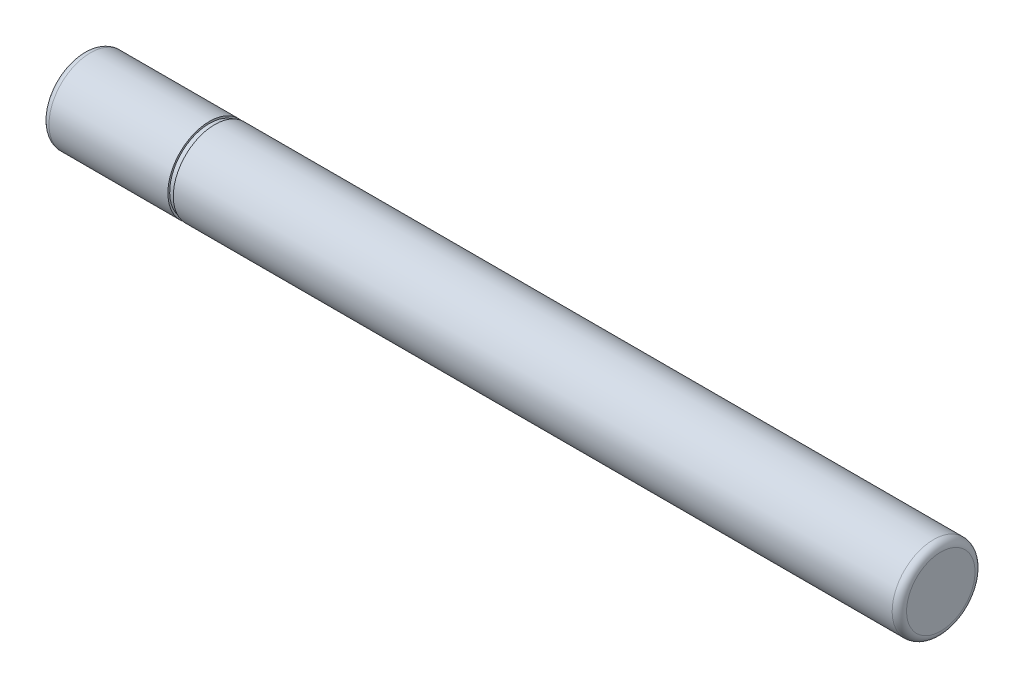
ISO-10303-21;
HEADER;
FILE_DESCRIPTION(('STEP AP214'),'2;1');
FILE_NAME('part.step','',(''),(''),'','','');
FILE_SCHEMA(('AUTOMOTIVE_DESIGN { 1 0 10303 214 1 1 1 1 }'));
ENDSEC;
DATA;
#1=APPLICATION_CONTEXT('core data for automotive mechanical design processes');
#2=APPLICATION_PROTOCOL_DEFINITION('international standard','automotive_design',2000,#1);
#3=PRODUCT_CONTEXT('',#1,'mechanical');
#4=PRODUCT('Part','Part','',(#3));
#5=PRODUCT_RELATED_PRODUCT_CATEGORY('part','',(#4));
#6=PRODUCT_DEFINITION_FORMATION('','',#4);
#7=PRODUCT_DEFINITION_CONTEXT('part definition',#1,'design');
#8=PRODUCT_DEFINITION('design','',#6,#7);
#9=PRODUCT_DEFINITION_SHAPE('','',#8);
#10=(LENGTH_UNIT() NAMED_UNIT(*) SI_UNIT(.MILLI.,.METRE.));
#11=(NAMED_UNIT(*) PLANE_ANGLE_UNIT() SI_UNIT($,.RADIAN.));
#12=(NAMED_UNIT(*) SI_UNIT($,.STERADIAN.) SOLID_ANGLE_UNIT());
#13=UNCERTAINTY_MEASURE_WITH_UNIT(LENGTH_MEASURE(1.E-05),#10,'distance_accuracy_value','');
#14=(GEOMETRIC_REPRESENTATION_CONTEXT(3) GLOBAL_UNCERTAINTY_ASSIGNED_CONTEXT((#13)) GLOBAL_UNIT_ASSIGNED_CONTEXT((#10,
#11,#12)) REPRESENTATION_CONTEXT('',''));
#15=CARTESIAN_POINT('',(0.,0.,0.));
#16=DIRECTION('',(0.,0.,1.));
#17=DIRECTION('',(1.,0.,0.));
#18=AXIS2_PLACEMENT_3D('',#15,#16,#17);
#19=CARTESIAN_POINT('',(237.,-11.4999999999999,0.));
#20=DIRECTION('',(1.,0.,0.));
#21=DIRECTION('',(0.,1.,0.));
#22=AXIS2_PLACEMENT_3D('',#19,#20,#21);
#23=PLANE('',#22);
#24=CARTESIAN_POINT('',(237.,0.,0.));
#25=DIRECTION('',(1.,0.,0.));
#26=DIRECTION('',(0.,1.,0.));
#27=AXIS2_PLACEMENT_3D('',#24,#25,#26);
#28=CIRCLE('',#27,9.49999999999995);
#29=CARTESIAN_POINT('',(237.,9.49999999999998,0.));
#30=VERTEX_POINT('',#29);
#31=EDGE_CURVE('E42',#30,#30,#28,.T.);
#32=ORIENTED_EDGE('',*,*,#31,.T.);
#33=EDGE_LOOP('',(#32));
#34=FACE_BOUND('',#33,.T.);
#35=ADVANCED_FACE('F35',(#34),#23,.T.);
#36=CARTESIAN_POINT('',(0.,-4.99999999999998,0.));
#37=DIRECTION('',(-1.,0.,0.));
#38=DIRECTION('',(0.,-1.,0.));
#39=AXIS2_PLACEMENT_3D('',#36,#37,#38);
#40=PLANE('',#39);
#41=CARTESIAN_POINT('',(0.,0.,0.));
#42=DIRECTION('',(1.,0.,0.));
#43=DIRECTION('',(0.,1.,0.));
#44=AXIS2_PLACEMENT_3D('',#41,#42,#43);
#45=CIRCLE('',#44,7.99999999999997);
#46=CARTESIAN_POINT('',(0.,7.99999999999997,0.));
#47=VERTEX_POINT('',#46);
#48=EDGE_CURVE('E55',#47,#47,#45,.T.);
#49=ORIENTED_EDGE('',*,*,#48,.F.);
#50=EDGE_LOOP('',(#49));
#51=FACE_BOUND('',#50,.T.);
#52=ADVANCED_FACE('F91',(#51),#40,.T.);
#53=CARTESIAN_POINT('',(0.,0.,0.));
#54=DIRECTION('',(1.,0.,0.));
#55=DIRECTION('',(0.,1.,0.));
#56=AXIS2_PLACEMENT_3D('',#53,#54,#55);
#57=CYLINDRICAL_SURFACE('',#56,7.99999999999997);
#58=ORIENTED_EDGE('',*,*,#48,.T.);
#59=EDGE_LOOP('',(#58));
#60=FACE_BOUND('',#59,.T.);
#61=CARTESIAN_POINT('',(-1.,0.,0.));
#62=DIRECTION('',(1.,0.,0.));
#63=DIRECTION('',(0.,1.,0.));
#64=AXIS2_PLACEMENT_3D('',#61,#62,#63);
#65=CIRCLE('',#64,7.99999999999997);
#66=CARTESIAN_POINT('',(-1.,7.99999999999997,0.));
#67=VERTEX_POINT('',#66);
#68=EDGE_CURVE('E58',#67,#67,#65,.T.);
#69=ORIENTED_EDGE('',*,*,#68,.F.);
#70=EDGE_LOOP('',(#69));
#71=FACE_BOUND('',#70,.T.);
#72=ADVANCED_FACE('F96',(#60,#71),#57,.F.);
#73=CARTESIAN_POINT('',(-0.999999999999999,-7.99999999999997,0.));
#74=DIRECTION('',(-1.,0.,0.));
#75=DIRECTION('',(0.,-1.,0.));
#76=AXIS2_PLACEMENT_3D('',#73,#74,#75);
#77=PLANE('',#76);
#78=CARTESIAN_POINT('',(-1.,0.,0.));
#79=DIRECTION('',(-1.,0.,0.));
#80=DIRECTION('',(0.,-1.,0.));
#81=AXIS2_PLACEMENT_3D('',#78,#79,#80);
#82=CIRCLE('',#81,9.49999999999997);
#83=CARTESIAN_POINT('',(-0.999999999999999,-9.49999999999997,0.));
#84=VERTEX_POINT('',#83);
#85=EDGE_CURVE('E46',#84,#84,#82,.T.);
#86=ORIENTED_EDGE('',*,*,#85,.T.);
#87=EDGE_LOOP('',(#86));
#88=FACE_BOUND('',#87,.T.);
#89=ORIENTED_EDGE('',*,*,#68,.T.);
#90=EDGE_LOOP('',(#89));
#91=FACE_BOUND('',#90,.T.);
#92=ADVANCED_FACE('F113',(#88,#91),#77,.T.);
#93=CARTESIAN_POINT('',(0.,0.,0.));
#94=DIRECTION('',(1.,0.,0.));
#95=DIRECTION('',(0.,1.,0.));
#96=AXIS2_PLACEMENT_3D('',#93,#94,#95);
#97=CYLINDRICAL_SURFACE('',#96,11.5);
#98=CARTESIAN_POINT('',(1.,0.,0.));
#99=DIRECTION('',(-1.,0.,0.));
#100=DIRECTION('',(0.,-1.,0.));
#101=AXIS2_PLACEMENT_3D('',#98,#99,#100);
#102=CIRCLE('',#101,11.5);
#103=CARTESIAN_POINT('',(1.,-11.5,0.));
#104=VERTEX_POINT('',#103);
#105=EDGE_CURVE('E50',#104,#104,#102,.F.);
#106=ORIENTED_EDGE('',*,*,#105,.T.);
#107=EDGE_LOOP('',(#106));
#108=FACE_BOUND('',#107,.T.);
#109=CARTESIAN_POINT('',(34.,0.,0.));
#110=DIRECTION('',(1.,0.,0.));
#111=DIRECTION('',(0.,1.,0.));
#112=AXIS2_PLACEMENT_3D('',#109,#110,#111);
#113=CIRCLE('',#112,11.5);
#114=CARTESIAN_POINT('',(34.,11.5,0.));
#115=VERTEX_POINT('',#114);
#116=EDGE_CURVE('E61',#115,#115,#113,.T.);
#117=ORIENTED_EDGE('',*,*,#116,.F.);
#118=EDGE_LOOP('',(#117));
#119=FACE_BOUND('',#118,.T.);
#120=ADVANCED_FACE('F110',(#108,#119),#97,.T.);
#121=CARTESIAN_POINT('',(34.,-11.5,0.));
#122=DIRECTION('',(1.,0.,0.));
#123=DIRECTION('',(0.,1.,0.));
#124=AXIS2_PLACEMENT_3D('',#121,#122,#123);
#125=PLANE('',#124);
#126=ORIENTED_EDGE('',*,*,#116,.T.);
#127=EDGE_LOOP('',(#126));
#128=FACE_BOUND('',#127,.T.);
#129=CARTESIAN_POINT('',(34.,0.,0.));
#130=DIRECTION('',(1.,0.,0.));
#131=DIRECTION('',(0.,1.,0.));
#132=AXIS2_PLACEMENT_3D('',#129,#130,#131);
#133=CIRCLE('',#132,11.);
#134=CARTESIAN_POINT('',(34.,11.,0.));
#135=VERTEX_POINT('',#134);
#136=EDGE_CURVE('E64',#135,#135,#133,.T.);
#137=ORIENTED_EDGE('',*,*,#136,.F.);
#138=EDGE_LOOP('',(#137));
#139=FACE_BOUND('',#138,.T.);
#140=ADVANCED_FACE('F87',(#128,#139),#125,.T.);
#141=CARTESIAN_POINT('',(0.,0.,0.));
#142=DIRECTION('',(1.,0.,0.));
#143=DIRECTION('',(0.,1.,0.));
#144=AXIS2_PLACEMENT_3D('',#141,#142,#143);
#145=CYLINDRICAL_SURFACE('',#144,11.);
#146=ORIENTED_EDGE('',*,*,#136,.T.);
#147=EDGE_LOOP('',(#146));
#148=FACE_BOUND('',#147,.T.);
#149=CARTESIAN_POINT('',(35.5,0.,0.));
#150=DIRECTION('',(1.,0.,0.));
#151=DIRECTION('',(0.,1.,0.));
#152=AXIS2_PLACEMENT_3D('',#149,#150,#151);
#153=CIRCLE('',#152,11.);
#154=CARTESIAN_POINT('',(35.5,11.,0.));
#155=VERTEX_POINT('',#154);
#156=EDGE_CURVE('E67',#155,#155,#153,.T.);
#157=ORIENTED_EDGE('',*,*,#156,.F.);
#158=EDGE_LOOP('',(#157));
#159=FACE_BOUND('',#158,.T.);
#160=ADVANCED_FACE('F78',(#148,#159),#145,.T.);
#161=CARTESIAN_POINT('',(35.5,-11.,0.));
#162=DIRECTION('',(-1.,0.,0.));
#163=DIRECTION('',(0.,-1.,0.));
#164=AXIS2_PLACEMENT_3D('',#161,#162,#163);
#165=PLANE('',#164);
#166=ORIENTED_EDGE('',*,*,#156,.T.);
#167=EDGE_LOOP('',(#166));
#168=FACE_BOUND('',#167,.T.);
#169=CARTESIAN_POINT('',(35.5,0.,0.));
#170=DIRECTION('',(1.,0.,0.));
#171=DIRECTION('',(0.,1.,0.));
#172=AXIS2_PLACEMENT_3D('',#169,#170,#171);
#173=CIRCLE('',#172,11.5);
#174=CARTESIAN_POINT('',(35.5,11.5,0.));
#175=VERTEX_POINT('',#174);
#176=EDGE_CURVE('E70',#175,#175,#173,.T.);
#177=ORIENTED_EDGE('',*,*,#176,.F.);
#178=EDGE_LOOP('',(#177));
#179=FACE_BOUND('',#178,.T.);
#180=ADVANCED_FACE('F76',(#168,#179),#165,.T.);
#181=CARTESIAN_POINT('',(0.,0.,0.));
#182=DIRECTION('',(1.,0.,0.));
#183=DIRECTION('',(0.,1.,0.));
#184=AXIS2_PLACEMENT_3D('',#181,#182,#183);
#185=CYLINDRICAL_SURFACE('',#184,11.5);
#186=CARTESIAN_POINT('',(235.,0.,0.));
#187=DIRECTION('',(1.,0.,0.));
#188=DIRECTION('',(0.,1.,0.));
#189=AXIS2_PLACEMENT_3D('',#186,#187,#188);
#190=CIRCLE('',#189,11.5);
#191=CARTESIAN_POINT('',(235.,11.5,0.));
#192=VERTEX_POINT('',#191);
#193=EDGE_CURVE('E10',#192,#192,#190,.F.);
#194=ORIENTED_EDGE('',*,*,#193,.T.);
#195=EDGE_LOOP('',(#194));
#196=FACE_BOUND('',#195,.T.);
#197=ORIENTED_EDGE('',*,*,#176,.T.);
#198=EDGE_LOOP('',(#197));
#199=FACE_BOUND('',#198,.T.);
#200=ADVANCED_FACE('F74',(#196,#199),#185,.T.);
#201=CARTESIAN_POINT('',(1.,0.,0.));
#202=DIRECTION('',(-1.,0.,0.));
#203=DIRECTION('',(0.,-1.,0.));
#204=AXIS2_PLACEMENT_3D('',#201,#202,#203);
#205=TOROIDAL_SURFACE('',#204,9.49999999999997,2.);
#206=ORIENTED_EDGE('',*,*,#85,.F.);
#207=EDGE_LOOP('',(#206));
#208=FACE_BOUND('',#207,.T.);
#209=ORIENTED_EDGE('',*,*,#105,.F.);
#210=EDGE_LOOP('',(#209));
#211=FACE_BOUND('',#210,.T.);
#212=ADVANCED_FACE('F85',(#208,#211),#205,.T.);
#213=CARTESIAN_POINT('',(235.,0.,0.));
#214=DIRECTION('',(1.,0.,0.));
#215=DIRECTION('',(0.,1.,0.));
#216=AXIS2_PLACEMENT_3D('',#213,#214,#215);
#217=TOROIDAL_SURFACE('',#216,9.49999999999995,2.);
#218=ORIENTED_EDGE('',*,*,#193,.F.);
#219=EDGE_LOOP('',(#218));
#220=FACE_BOUND('',#219,.T.);
#221=ORIENTED_EDGE('',*,*,#31,.F.);
#222=EDGE_LOOP('',(#221));
#223=FACE_BOUND('',#222,.T.);
#224=ADVANCED_FACE('F37',(#220,#223),#217,.T.);
#225=CLOSED_SHELL('',(#35,#52,#72,#92,#120,#140,#160,#180,#200,#212,#224));
#226=MANIFOLD_SOLID_BREP('B2',#225);
#227=ADVANCED_BREP_SHAPE_REPRESENTATION('',(#18,#226),#14);
#228=SHAPE_DEFINITION_REPRESENTATION(#9,#227);
ENDSEC;
END-ISO-10303-21;
